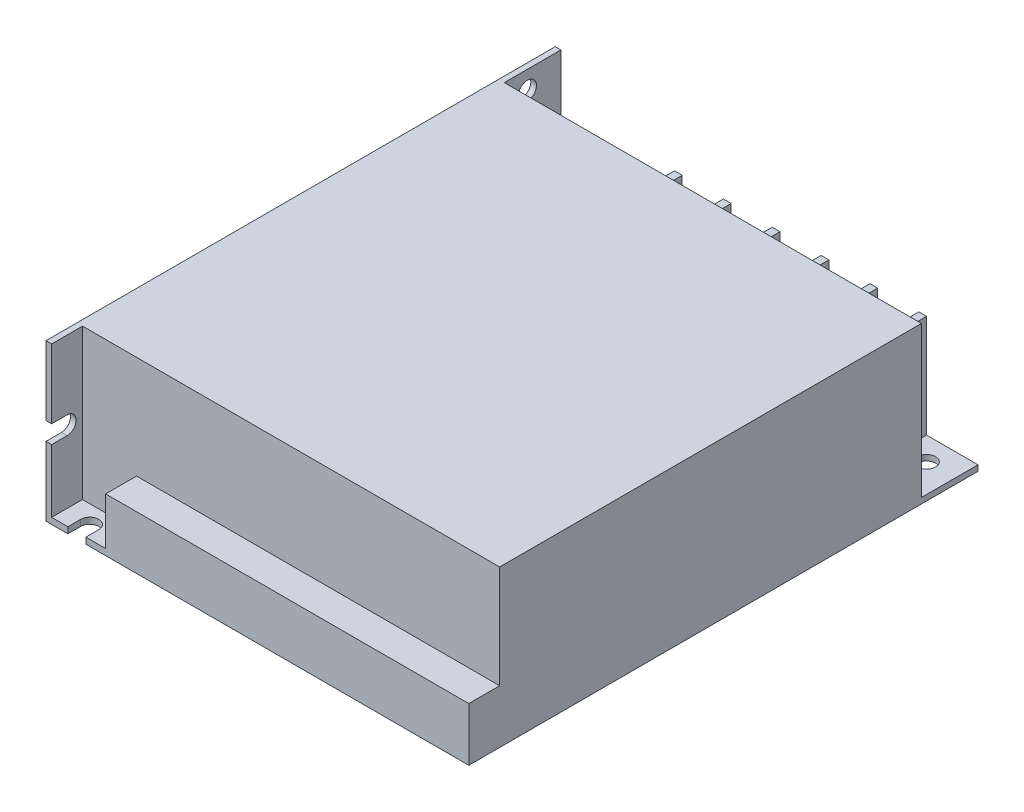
from build123d import *

# Parameters (mm, degrees)
SKETCH_1_W          = 82.2
SKETCH_1_H          = 99
EXTRUDE_1_DEPTH     = 30.4
SKETCH_3_W          = 81.1
SKETCH_3_H          = 6
CUT_EXTRUDE_1_DEPTH = 20
SKETCH_4_R          = 1.5
CUT_EXTRUDE_2_DEPTH = 3
SKETCH_5_R          = 1.75
CUT_EXTRUDE_3_DEPTH = 133.219514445
SKETCH_6_W          = 81.1
SKETCH_6_H          = 11
CUT_EXTRUDE_4_DEPTH = 29.3
SKETCH_7_R          = 1.75
CUT_EXTRUDE_5_DEPTH = 3
SKETCH_8_W          = 49
SKETCH_8_H          = 11
EXTRUDE_2_DEPTH     = 20
SKETCH_9_W          = 22.1
SKETCH_9_H          = 11
EXTRUDE_3_DEPTH     = 5.5
SKETCH_10_W         = 8
SKETCH_10_H         = 11
CUT_EXTRUDE_6_DEPTH = 8
SKETCH_11_R         = 3.25
EXTRUDE_4_DEPTH     = 4.5
FILLET_1_R          = 2
SKETCH_12_R         = 1.75
CUT_EXTRUDE_7_DEPTH = 4.5
SKETCH_13_W         = 10.5
SKETCH_13_H         = 6
CUT_EXTRUDE_8_DEPTH = 9.2
CUT_EXTRUDE_9_DEPTH = 133.219514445


with BuildPart() as part:
    # Sketch 1 → Extrude 1 (new body)
    with BuildSketch(Plane(origin=(0, 0, 0), x_dir=(1, 0, 0), z_dir=(0, 1, 0))):
        with Locations((41.1, 49.5)):
            Rectangle(SKETCH_1_W, SKETCH_1_H)
    extrude(amount=EXTRUDE_1_DEPTH)

    # Sketch 3 → Cut-Extrude 1 (cut)
    with BuildSketch(Plane(origin=(0, 30.4, 0), x_dir=(1, 0, 0), z_dir=(0, 1, 0))):
        with Locations((41.65, 3)):
            Rectangle(SKETCH_3_W, SKETCH_3_H)
    extrude(amount=-CUT_EXTRUDE_1_DEPTH, mode=Mode.SUBTRACT)

    # Sketch 4 → Cut-Extrude 2 (cut)
    with BuildSketch(Plane.XZ):
        with Locations(Location((40.5, -23.5, 0), (0, 0, 270))):
            Circle(SKETCH_4_R)
        with Locations(Location((40.5, -78.5, 0), (0, 0, 270))):
            Circle(SKETCH_4_R)
    extrude(amount=-CUT_EXTRUDE_2_DEPTH, mode=Mode.SUBTRACT)

    # Sketch 5 → Cut-Extrude 3 (cut, through all)
    with BuildSketch(Plane.XZ):
        with Locations(Location((76.7, -94.5, 0), (0, 0, 270))):
            Circle(SKETCH_5_R)
    extrude(amount=-CUT_EXTRUDE_3_DEPTH, mode=Mode.SUBTRACT)

    # Sketch 6 → Cut-Extrude 4 (cut)
    with BuildSketch(Plane(origin=(0, 30.4, 0), x_dir=(1, 0, 0), z_dir=(0, 1, 0))):
        with Locations((41.65, 93.5)):
            Rectangle(SKETCH_6_W, SKETCH_6_H)
    extrude(amount=-CUT_EXTRUDE_4_DEPTH, mode=Mode.SUBTRACT)

    # Sketch 7 → Cut-Extrude 5 (cut)
    with BuildSketch(Plane.ZY):
        with Locations((-89, 15.2)):
            Circle(SKETCH_7_R)
        with Locations((-15, 15.2)):
            Circle(SKETCH_7_R)
        with BuildLine():
            Line((-3, 16.95), (0, 16.95))
            Line((0, 16.95), (0, 13.45))
            Line((0, 13.45), (-3, 13.45))
            ThreePointArc((-3, 13.45), (-4.75, 15.2), (-3, 16.95))
        make_face()
    extrude(amount=-CUT_EXTRUDE_5_DEPTH, mode=Mode.SUBTRACT)

    # Sketch 8 → Extrude 2 (add)
    with BuildSketch(Plane(origin=(0, 1.1, 0), x_dir=(1, 0, 0), z_dir=(0, 1, 0))):
        with Locations((47.7, 93.5)):
            Rectangle(SKETCH_8_W, SKETCH_8_H)
    extrude(amount=EXTRUDE_2_DEPTH)

    # Sketch 9 → Extrude 3 (add)
    with BuildSketch(Plane(origin=(0, 1.1, 0), x_dir=(1, 0, 0), z_dir=(0, 1, 0))):
        with Locations((12.15, 93.5)):
            Rectangle(SKETCH_9_W, SKETCH_9_H)
    extrude(amount=EXTRUDE_3_DEPTH)

    # Sketch 10 → Cut-Extrude 6 (cut)
    with BuildSketch(Plane(origin=(0, 21.1, 0), x_dir=(1, 0, 0), z_dir=(0, 1, 0))):
        with Locations((66.7, 93.5)):
            Rectangle(SKETCH_10_W, SKETCH_10_H)
        with Locations((57.2, 93.5)):
            Rectangle(SKETCH_10_W, SKETCH_10_H)
        with Locations((47.7, 93.5)):
            Rectangle(SKETCH_10_W, SKETCH_10_H)
        with Locations((38.2, 93.5)):
            Rectangle(SKETCH_10_W, SKETCH_10_H)
        with Locations((28.7, 93.5)):
            Rectangle(SKETCH_10_W, SKETCH_10_H)
    extrude(amount=-CUT_EXTRUDE_6_DEPTH, mode=Mode.SUBTRACT)

    # Sketch 11 → Extrude 4 (add)
    with BuildSketch(Plane(origin=(0, 13.1, 0), x_dir=(1, 0, 0), z_dir=(0, 1, 0))):
        with Locations(Location((66.7, 93.5, 0), (0, 0, 270))):
            Circle(SKETCH_11_R)
        with Locations(Location((57.2, 93.5, 0), (0, 0, 270))):
            Circle(SKETCH_11_R)
        with Locations(Location((47.7, 93.5, 0), (0, 0, 270))):
            Circle(SKETCH_11_R)
        with Locations(Location((38.2, 93.5, 0), (0, 0, 270))):
            Circle(SKETCH_11_R)
        with Locations(Location((28.7, 93.5, 0), (0, 0, 270))):
            Circle(SKETCH_11_R)
    extrude(amount=EXTRUDE_4_DEPTH)

    # Fillet 1
    fillet_1_edges = [part.edges().sort_by_distance(p)[0] for p in [
        (66.7, 17.6, -96.75),
        (57.2, 17.6, -96.75),
        (47.7, 17.6, -96.75),
        (38.2, 17.6, -96.75),
        (28.7, 17.6, -96.75),
    ]]
    fillet(fillet_1_edges, radius=FILLET_1_R)

    # Sketch 12 → Cut-Extrude 7 (cut)
    with BuildSketch(Plane.ZY):
        with Locations((-92.5, 26.8)):
            Circle(SKETCH_12_R)
    extrude(amount=-CUT_EXTRUDE_7_DEPTH, mode=Mode.SUBTRACT)

    # Sketch 13 → Cut-Extrude 8 (cut)
    with BuildSketch(Plane(origin=(0, 10.4, 0), x_dir=(1, 0, 0), z_dir=(0, 1, 0))):
        with Locations((6.35, 3)):
            Rectangle(SKETCH_13_W, SKETCH_13_H)
    extrude(amount=-CUT_EXTRUDE_8_DEPTH, mode=Mode.SUBTRACT)

    # Sketch 14 → Cut-Extrude 9 (cut, through all)
    with BuildSketch(Plane.XZ):
        with BuildLine():
            Line((7.75, -2.5), (7.75, 0))
            Line((7.75, 0), (4.25, 0))
            Line((4.25, 0), (4.25, -2.5))
            ThreePointArc((4.25, -2.5), (6, -4.25), (7.75, -2.5))
        make_face()
    extrude(amount=-CUT_EXTRUDE_9_DEPTH, mode=Mode.SUBTRACT)


solid = part.part
